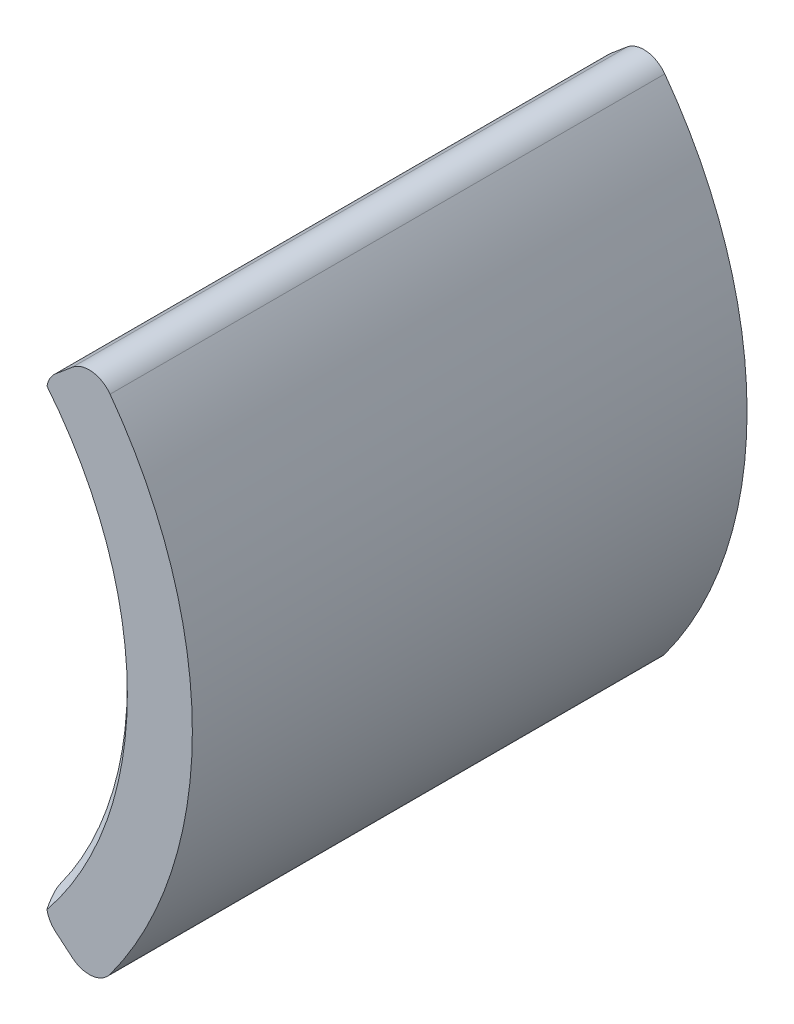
ISO-10303-21;
HEADER;
FILE_DESCRIPTION(('STEP AP214'),'2;1');
FILE_NAME('part.step','',(''),(''),'','','');
FILE_SCHEMA(('AUTOMOTIVE_DESIGN { 1 0 10303 214 1 1 1 1 }'));
ENDSEC;
DATA;
#1=APPLICATION_CONTEXT('core data for automotive mechanical design processes');
#2=APPLICATION_PROTOCOL_DEFINITION('international standard','automotive_design',2000,#1);
#3=PRODUCT_CONTEXT('',#1,'mechanical');
#4=PRODUCT('Part','Part','',(#3));
#5=PRODUCT_RELATED_PRODUCT_CATEGORY('part','',(#4));
#6=PRODUCT_DEFINITION_FORMATION('','',#4);
#7=PRODUCT_DEFINITION_CONTEXT('part definition',#1,'design');
#8=PRODUCT_DEFINITION('design','',#6,#7);
#9=PRODUCT_DEFINITION_SHAPE('','',#8);
#10=(LENGTH_UNIT() NAMED_UNIT(*) SI_UNIT(.MILLI.,.METRE.));
#11=(NAMED_UNIT(*) PLANE_ANGLE_UNIT() SI_UNIT($,.RADIAN.));
#12=(NAMED_UNIT(*) SI_UNIT($,.STERADIAN.) SOLID_ANGLE_UNIT());
#13=UNCERTAINTY_MEASURE_WITH_UNIT(LENGTH_MEASURE(1.E-05),#10,'distance_accuracy_value','');
#14=(GEOMETRIC_REPRESENTATION_CONTEXT(3) GLOBAL_UNCERTAINTY_ASSIGNED_CONTEXT((#13)) GLOBAL_UNIT_ASSIGNED_CONTEXT((#10,
#11,#12)) REPRESENTATION_CONTEXT('',''));
#15=CARTESIAN_POINT('',(0.,0.,0.));
#16=DIRECTION('',(0.,0.,1.));
#17=DIRECTION('',(1.,0.,0.));
#18=AXIS2_PLACEMENT_3D('',#15,#16,#17);
#19=CARTESIAN_POINT('',(0.,0.,64.));
#20=DIRECTION('',(0.,0.,-1.));
#21=DIRECTION('',(-1.,0.,0.));
#22=AXIS2_PLACEMENT_3D('',#19,#20,#21);
#23=CYLINDRICAL_SURFACE('',#22,49.);
#24=CARTESIAN_POINT('',(0.,0.,64.));
#25=DIRECTION('',(0.,0.,1.));
#26=DIRECTION('',(1.,0.,0.));
#27=AXIS2_PLACEMENT_3D('',#24,#25,#26);
#28=CIRCLE('',#27,49.);
#29=CARTESIAN_POINT('',(39.5103918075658,-28.9815275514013,64.));
#30=VERTEX_POINT('',#29);
#31=CARTESIAN_POINT('',(39.5103918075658,28.9815275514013,64.));
#32=VERTEX_POINT('',#31);
#33=EDGE_CURVE('E132',#30,#32,#28,.T.);
#34=ORIENTED_EDGE('',*,*,#33,.F.);
#35=DIRECTION('',(0.,0.,-1.));
#36=VECTOR('',#35,1.);
#37=CARTESIAN_POINT('',(39.5103918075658,-28.9815275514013,64.));
#38=LINE('',#37,#36);
#39=CARTESIAN_POINT('',(39.5103918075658,-28.9815275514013,0.));
#40=VERTEX_POINT('',#39);
#41=EDGE_CURVE('E117',#30,#40,#38,.T.);
#42=ORIENTED_EDGE('',*,*,#41,.T.);
#43=CARTESIAN_POINT('',(0.,0.,0.));
#44=DIRECTION('',(0.,0.,1.));
#45=DIRECTION('',(1.,0.,0.));
#46=AXIS2_PLACEMENT_3D('',#43,#44,#45);
#47=CIRCLE('',#46,49.);
#48=CARTESIAN_POINT('',(39.5103918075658,28.9815275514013,0.));
#49=VERTEX_POINT('',#48);
#50=EDGE_CURVE('E129',#40,#49,#47,.T.);
#51=ORIENTED_EDGE('',*,*,#50,.T.);
#52=DIRECTION('',(0.,0.,-1.));
#53=VECTOR('',#52,1.);
#54=CARTESIAN_POINT('',(39.5103918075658,28.9815275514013,64.));
#55=LINE('',#54,#53);
#56=EDGE_CURVE('E134',#49,#32,#55,.F.);
#57=ORIENTED_EDGE('',*,*,#56,.T.);
#58=EDGE_LOOP('',(#34,#42,#51,#57));
#59=FACE_BOUND('',#58,.T.);
#60=ADVANCED_FACE('F35',(#59),#23,.T.);
#61=CARTESIAN_POINT('',(31.0247999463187,26.0328981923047,64.));
#62=DIRECTION('',(0.642787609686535,-0.766044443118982,0.));
#63=DIRECTION('',(0.766044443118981,0.642787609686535,0.));
#64=AXIS2_PLACEMENT_3D('',#61,#62,#63);
#65=PLANE('',#64);
#66=DIRECTION('',(-0.766044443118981,-0.642787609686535,0.));
#67=VECTOR('',#66,1.);
#68=CARTESIAN_POINT('',(31.0247999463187,26.0328981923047,64.));
#69=LINE('',#68,#67);
#70=CARTESIAN_POINT('',(35.1630253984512,29.5052816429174,64.));
#71=VERTEX_POINT('',#70);
#72=CARTESIAN_POINT('',(33.2435928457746,27.8946864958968,64.));
#73=VERTEX_POINT('',#72);
#74=EDGE_CURVE('E150',#71,#73,#69,.T.);
#75=ORIENTED_EDGE('',*,*,#74,.F.);
#76=DIRECTION('',(0.,0.,-1.));
#77=VECTOR('',#76,1.);
#78=CARTESIAN_POINT('',(35.1630253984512,29.5052816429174,64.));
#79=LINE('',#78,#77);
#80=CARTESIAN_POINT('',(35.1630253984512,29.5052816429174,0.));
#81=VERTEX_POINT('',#80);
#82=EDGE_CURVE('E11',#71,#81,#79,.T.);
#83=ORIENTED_EDGE('',*,*,#82,.T.);
#84=DIRECTION('',(-0.766044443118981,-0.642787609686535,0.));
#85=VECTOR('',#84,1.);
#86=CARTESIAN_POINT('',(31.0247999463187,26.0328981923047,0.));
#87=LINE('',#86,#85);
#88=CARTESIAN_POINT('',(33.2435928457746,27.8946864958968,0.));
#89=VERTEX_POINT('',#88);
#90=EDGE_CURVE('E139',#81,#89,#87,.T.);
#91=ORIENTED_EDGE('',*,*,#90,.T.);
#92=DIRECTION('',(0.,0.,-1.));
#93=VECTOR('',#92,1.);
#94=CARTESIAN_POINT('',(33.2435928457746,27.8946864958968,64.));
#95=LINE('',#94,#93);
#96=EDGE_CURVE('E42',#89,#73,#95,.F.);
#97=ORIENTED_EDGE('',*,*,#96,.T.);
#98=EDGE_LOOP('',(#75,#83,#91,#97));
#99=FACE_BOUND('',#98,.T.);
#100=ADVANCED_FACE('F229',(#99),#65,.F.);
#101=CARTESIAN_POINT('',(0.,0.,64.));
#102=DIRECTION('',(0.,0.,-1.));
#103=DIRECTION('',(-1.,0.,0.));
#104=AXIS2_PLACEMENT_3D('',#101,#102,#103);
#105=CYLINDRICAL_SURFACE('',#104,40.5);
#106=CARTESIAN_POINT('',(0.,0.,0.999999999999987));
#107=DIRECTION('',(0.,0.,1.));
#108=DIRECTION('',(1.,0.,0.));
#109=AXIS2_PLACEMENT_3D('',#106,#107,#108);
#110=CIRCLE('',#109,40.5);
#111=CARTESIAN_POINT('',(32.7463035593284,23.831273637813,0.999999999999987));
#112=VERTEX_POINT('',#111);
#113=CARTESIAN_POINT('',(32.7463035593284,-23.831273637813,0.999999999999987));
#114=VERTEX_POINT('',#113);
#115=EDGE_CURVE('E155',#112,#114,#110,.F.);
#116=ORIENTED_EDGE('',*,*,#115,.T.);
#117=DIRECTION('',(0.,0.,-1.));
#118=VECTOR('',#117,1.);
#119=CARTESIAN_POINT('',(32.7463035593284,-23.831273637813,64.));
#120=LINE('',#119,#118);
#121=CARTESIAN_POINT('',(32.7463035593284,-23.831273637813,63.));
#122=VERTEX_POINT('',#121);
#123=EDGE_CURVE('E56',#114,#122,#120,.F.);
#124=ORIENTED_EDGE('',*,*,#123,.T.);
#125=CARTESIAN_POINT('',(0.,0.,63.));
#126=DIRECTION('',(0.,0.,1.));
#127=DIRECTION('',(1.,0.,0.));
#128=AXIS2_PLACEMENT_3D('',#125,#126,#127);
#129=CIRCLE('',#128,40.5);
#130=CARTESIAN_POINT('',(32.7463035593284,23.831273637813,63.));
#131=VERTEX_POINT('',#130);
#132=EDGE_CURVE('E153',#122,#131,#129,.T.);
#133=ORIENTED_EDGE('',*,*,#132,.T.);
#134=DIRECTION('',(0.,0.,-1.));
#135=VECTOR('',#134,1.);
#136=CARTESIAN_POINT('',(32.7463035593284,23.831273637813,64.));
#137=LINE('',#136,#135);
#138=EDGE_CURVE('E259',#131,#112,#137,.T.);
#139=ORIENTED_EDGE('',*,*,#138,.T.);
#140=EDGE_LOOP('',(#116,#124,#133,#139));
#141=FACE_BOUND('',#140,.T.);
#142=ADVANCED_FACE('F233',(#141),#105,.F.);
#143=CARTESIAN_POINT('',(0.,0.,64.));
#144=DIRECTION('',(0.,0.,1.));
#145=DIRECTION('',(1.,0.,0.));
#146=AXIS2_PLACEMENT_3D('',#143,#144,#145);
#147=PLANE('',#146);
#148=DIRECTION('',(-0.766044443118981,0.642787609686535,0.));
#149=VECTOR('',#148,1.);
#150=CARTESIAN_POINT('',(31.0247999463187,-26.0328981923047,64.));
#151=LINE('',#150,#149);
#152=CARTESIAN_POINT('',(35.1630253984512,-29.5052816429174,64.));
#153=VERTEX_POINT('',#152);
#154=CARTESIAN_POINT('',(33.2435928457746,-27.8946864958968,64.));
#155=VERTEX_POINT('',#154);
#156=EDGE_CURVE('E140',#153,#155,#151,.T.);
#157=ORIENTED_EDGE('',*,*,#156,.F.);
#158=CARTESIAN_POINT('',(37.0913882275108,-27.2071483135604,64.));
#159=DIRECTION('',(0.,0.,1.));
#160=DIRECTION('',(1.,0.,0.));
#161=AXIS2_PLACEMENT_3D('',#158,#159,#160);
#162=CIRCLE('',#161,3.);
#163=EDGE_CURVE('E176',#153,#30,#162,.T.);
#164=ORIENTED_EDGE('',*,*,#163,.T.);
#165=ORIENTED_EDGE('',*,*,#33,.T.);
#166=CARTESIAN_POINT('',(37.0913882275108,27.2071483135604,64.));
#167=DIRECTION('',(0.,0.,1.));
#168=DIRECTION('',(1.,0.,0.));
#169=AXIS2_PLACEMENT_3D('',#166,#167,#168);
#170=CIRCLE('',#169,3.);
#171=EDGE_CURVE('E172',#32,#71,#170,.T.);
#172=ORIENTED_EDGE('',*,*,#171,.T.);
#173=ORIENTED_EDGE('',*,*,#74,.T.);
#174=CARTESIAN_POINT('',(35.1719556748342,25.5965531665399,64.));
#175=DIRECTION('',(0.,0.,1.));
#176=DIRECTION('',(1.,0.,0.));
#177=AXIS2_PLACEMENT_3D('',#174,#175,#176);
#178=CIRCLE('',#177,3.);
#179=CARTESIAN_POINT('',(32.2236724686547,26.1511937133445,64.));
#180=VERTEX_POINT('',#179);
#181=EDGE_CURVE('E170',#73,#180,#178,.T.);
#182=ORIENTED_EDGE('',*,*,#181,.T.);
#183=CARTESIAN_POINT('',(0.,0.,64.));
#184=DIRECTION('',(0.,0.,1.));
#185=DIRECTION('',(1.,0.,0.));
#186=AXIS2_PLACEMENT_3D('',#183,#184,#185);
#187=CIRCLE('',#186,41.5);
#188=CARTESIAN_POINT('',(32.2236724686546,-26.1511937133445,64.));
#189=VERTEX_POINT('',#188);
#190=EDGE_CURVE('E160',#180,#189,#187,.F.);
#191=ORIENTED_EDGE('',*,*,#190,.T.);
#192=CARTESIAN_POINT('',(35.1719556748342,-25.5965531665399,64.));
#193=DIRECTION('',(0.,0.,1.));
#194=DIRECTION('',(1.,0.,0.));
#195=AXIS2_PLACEMENT_3D('',#192,#193,#194);
#196=CIRCLE('',#195,3.);
#197=EDGE_CURVE('E174',#189,#155,#196,.T.);
#198=ORIENTED_EDGE('',*,*,#197,.T.);
#199=EDGE_LOOP('',(#157,#164,#165,#172,#173,#182,#191,#198));
#200=FACE_BOUND('',#199,.T.);
#201=ADVANCED_FACE('F238',(#200),#147,.T.);
#202=CARTESIAN_POINT('',(0.,0.,0.));
#203=DIRECTION('',(0.,0.,1.));
#204=DIRECTION('',(1.,0.,0.));
#205=AXIS2_PLACEMENT_3D('',#202,#203,#204);
#206=PLANE('',#205);
#207=ORIENTED_EDGE('',*,*,#50,.F.);
#208=CARTESIAN_POINT('',(37.0913882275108,-27.2071483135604,0.));
#209=DIRECTION('',(0.,0.,1.));
#210=DIRECTION('',(1.,0.,0.));
#211=AXIS2_PLACEMENT_3D('',#208,#209,#210);
#212=CIRCLE('',#211,3.);
#213=CARTESIAN_POINT('',(35.1630253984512,-29.5052816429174,0.));
#214=VERTEX_POINT('',#213);
#215=EDGE_CURVE('E113',#40,#214,#212,.F.);
#216=ORIENTED_EDGE('',*,*,#215,.T.);
#217=DIRECTION('',(-0.766044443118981,0.642787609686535,0.));
#218=VECTOR('',#217,1.);
#219=CARTESIAN_POINT('',(31.0247999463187,-26.0328981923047,0.));
#220=LINE('',#219,#218);
#221=CARTESIAN_POINT('',(33.2435928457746,-27.8946864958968,0.));
#222=VERTEX_POINT('',#221);
#223=EDGE_CURVE('E145',#214,#222,#220,.T.);
#224=ORIENTED_EDGE('',*,*,#223,.T.);
#225=CARTESIAN_POINT('',(35.1719556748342,-25.5965531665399,0.));
#226=DIRECTION('',(0.,0.,1.));
#227=DIRECTION('',(1.,0.,0.));
#228=AXIS2_PLACEMENT_3D('',#225,#226,#227);
#229=CIRCLE('',#228,3.);
#230=CARTESIAN_POINT('',(32.2236724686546,-26.1511937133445,0.));
#231=VERTEX_POINT('',#230);
#232=EDGE_CURVE('E124',#222,#231,#229,.F.);
#233=ORIENTED_EDGE('',*,*,#232,.T.);
#234=CARTESIAN_POINT('',(0.,0.,0.));
#235=DIRECTION('',(0.,0.,1.));
#236=DIRECTION('',(1.,0.,0.));
#237=AXIS2_PLACEMENT_3D('',#234,#235,#236);
#238=CIRCLE('',#237,41.5);
#239=CARTESIAN_POINT('',(32.2236724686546,26.1511937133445,0.));
#240=VERTEX_POINT('',#239);
#241=EDGE_CURVE('E157',#231,#240,#238,.T.);
#242=ORIENTED_EDGE('',*,*,#241,.T.);
#243=CARTESIAN_POINT('',(35.1719556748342,25.5965531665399,0.));
#244=DIRECTION('',(0.,0.,1.));
#245=DIRECTION('',(1.,0.,0.));
#246=AXIS2_PLACEMENT_3D('',#243,#244,#245);
#247=CIRCLE('',#246,3.);
#248=EDGE_CURVE('E133',#240,#89,#247,.F.);
#249=ORIENTED_EDGE('',*,*,#248,.T.);
#250=ORIENTED_EDGE('',*,*,#90,.F.);
#251=CARTESIAN_POINT('',(37.0913882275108,27.2071483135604,0.));
#252=DIRECTION('',(0.,0.,1.));
#253=DIRECTION('',(1.,0.,0.));
#254=AXIS2_PLACEMENT_3D('',#251,#252,#253);
#255=CIRCLE('',#254,3.);
#256=EDGE_CURVE('E138',#81,#49,#255,.F.);
#257=ORIENTED_EDGE('',*,*,#256,.T.);
#258=EDGE_LOOP('',(#207,#216,#224,#233,#242,#249,#250,#257));
#259=FACE_BOUND('',#258,.T.);
#260=ADVANCED_FACE('F136',(#259),#206,.F.);
#261=CARTESIAN_POINT('',(31.0247999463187,-26.0328981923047,64.));
#262=DIRECTION('',(-0.642787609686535,-0.766044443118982,0.));
#263=DIRECTION('',(0.766044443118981,-0.642787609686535,0.));
#264=AXIS2_PLACEMENT_3D('',#261,#262,#263);
#265=PLANE('',#264);
#266=ORIENTED_EDGE('',*,*,#223,.F.);
#267=DIRECTION('',(0.,0.,1.));
#268=VECTOR('',#267,1.);
#269=CARTESIAN_POINT('',(35.1630253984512,-29.5052816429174,64.));
#270=LINE('',#269,#268);
#271=EDGE_CURVE('E118',#214,#153,#270,.T.);
#272=ORIENTED_EDGE('',*,*,#271,.T.);
#273=ORIENTED_EDGE('',*,*,#156,.T.);
#274=DIRECTION('',(0.,0.,1.));
#275=VECTOR('',#274,1.);
#276=CARTESIAN_POINT('',(33.2435928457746,-27.8946864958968,1.));
#277=LINE('',#276,#275);
#278=EDGE_CURVE('E123',#155,#222,#277,.F.);
#279=ORIENTED_EDGE('',*,*,#278,.T.);
#280=EDGE_LOOP('',(#266,#272,#273,#279));
#281=FACE_BOUND('',#280,.T.);
#282=ADVANCED_FACE('F246',(#281),#265,.T.);
#283=CARTESIAN_POINT('',(0.,0.,0.999999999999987));
#284=DIRECTION('',(0.,0.,-1.));
#285=DIRECTION('',(-1.,0.,0.));
#286=AXIS2_PLACEMENT_3D('',#283,#284,#285);
#287=CONICAL_SURFACE('',#286,40.5,0.785398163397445);
#288=ORIENTED_EDGE('',*,*,#241,.F.);
#289=CARTESIAN_POINT('',(32.2236724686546,-26.1511937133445,0.));
#290=CARTESIAN_POINT('',(32.2103514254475,-26.0803026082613,0.0550138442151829));
#291=CARTESIAN_POINT('',(32.1994088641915,-26.0081324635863,0.108911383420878));
#292=CARTESIAN_POINT('',(32.1827254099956,-25.8611500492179,0.214116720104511));
#293=CARTESIAN_POINT('',(32.1769941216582,-25.7863331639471,0.265419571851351));
#294=CARTESIAN_POINT('',(32.1682774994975,-25.5563131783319,0.415823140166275));
#295=CARTESIAN_POINT('',(32.1741225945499,-25.3972904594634,0.510038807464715));
#296=CARTESIAN_POINT('',(32.2087179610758,-25.1122841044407,0.658634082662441));
#297=CARTESIAN_POINT('',(32.2315267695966,-24.9877144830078,0.717123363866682));
#298=CARTESIAN_POINT('',(32.2946110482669,-24.7379064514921,0.819634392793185));
#299=CARTESIAN_POINT('',(32.3347502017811,-24.6126806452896,0.863764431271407));
#300=CARTESIAN_POINT('',(32.4064903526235,-24.4321064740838,0.915458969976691));
#301=CARTESIAN_POINT('',(32.4308866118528,-24.3757486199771,0.929864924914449));
#302=CARTESIAN_POINT('',(32.4834677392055,-24.2639461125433,0.954826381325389));
#303=CARTESIAN_POINT('',(32.511651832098,-24.2085012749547,0.96538266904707));
#304=CARTESIAN_POINT('',(32.5721193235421,-24.0982707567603,0.982526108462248));
#305=CARTESIAN_POINT('',(32.6044524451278,-24.0435037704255,0.98905836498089));
#306=CARTESIAN_POINT('',(32.6727281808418,-23.9358446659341,0.997805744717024));
#307=CARTESIAN_POINT('',(32.7086738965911,-23.8829542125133,1.00001712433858));
#308=CARTESIAN_POINT('',(32.7463035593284,-23.831273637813,0.999999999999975));
#309=B_SPLINE_CURVE_WITH_KNOTS('',3,(#289,#290,#291,#292,#293,#294,#295,#296,#297,#298,#299,
#300,#301,#302,#303,#304,#305,#306,#307,#308),.UNSPECIFIED.,.F.,.F.,(4,2,2,2,2,2,2,2,2,4),(0.,
0.272028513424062,0.544557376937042,1.09632284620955,1.51335887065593,1.92717269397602,
2.11621517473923,2.30521902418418,2.49674722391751,2.68844128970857),.UNSPECIFIED.);
#310=EDGE_CURVE('E185',#231,#114,#309,.T.);
#311=ORIENTED_EDGE('',*,*,#310,.T.);
#312=ORIENTED_EDGE('',*,*,#115,.F.);
#313=CARTESIAN_POINT('',(32.7463035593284,23.831273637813,0.999999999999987));
#314=CARTESIAN_POINT('',(32.7072914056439,23.8848497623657,1.00001983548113));
#315=CARTESIAN_POINT('',(32.6700917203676,23.9397267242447,0.997641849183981));
#316=CARTESIAN_POINT('',(32.5995878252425,24.0514783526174,0.988243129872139));
#317=CARTESIAN_POINT('',(32.5662800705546,24.1083511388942,0.981226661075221));
#318=CARTESIAN_POINT('',(32.5041909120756,24.2227930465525,0.962831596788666));
#319=CARTESIAN_POINT('',(32.475353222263,24.2803416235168,0.951514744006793));
#320=CARTESIAN_POINT('',(32.4217495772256,24.396363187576,0.924780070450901));
#321=CARTESIAN_POINT('',(32.3969842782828,24.4548363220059,0.909361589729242));
#322=CARTESIAN_POINT('',(32.3289996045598,24.6304869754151,0.857526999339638));
#323=CARTESIAN_POINT('',(32.2918191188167,24.7484051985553,0.815446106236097));
#324=CARTESIAN_POINT('',(32.2326988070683,24.983652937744,0.718665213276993));
#325=CARTESIAN_POINT('',(32.2108706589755,25.1009720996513,0.663876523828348));
#326=CARTESIAN_POINT('',(32.1749770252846,25.3822155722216,0.518718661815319));
#327=CARTESIAN_POINT('',(32.1683054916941,25.5444468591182,0.423189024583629));
#328=CARTESIAN_POINT('',(32.1765015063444,25.7790659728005,0.270350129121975));
#329=CARTESIAN_POINT('',(32.1821854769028,25.855412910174,0.218132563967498));
#330=CARTESIAN_POINT('',(32.1989878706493,26.0053427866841,0.110993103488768));
#331=CARTESIAN_POINT('',(32.2100952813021,26.0789310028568,0.0560768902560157));
#332=CARTESIAN_POINT('',(32.2236724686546,26.1511937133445,0.));
#333=B_SPLINE_CURVE_WITH_KNOTS('',3,(#313,#314,#315,#316,#317,#318,#319,#320,#321,#322,#323,
#324,#325,#326,#327,#328,#329,#330,#331,#332),.UNSPECIFIED.,.F.,.F.,(4,2,2,2,2,2,2,2,2,4),(0.,
0.198721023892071,0.397259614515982,0.593049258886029,0.788870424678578,1.17878455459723,
1.57150650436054,2.13339445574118,2.41123473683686,2.6885131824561),.UNSPECIFIED.);
#334=EDGE_CURVE('E178',#112,#240,#333,.T.);
#335=ORIENTED_EDGE('',*,*,#334,.T.);
#336=EDGE_LOOP('',(#288,#311,#312,#335));
#337=FACE_BOUND('',#336,.T.);
#338=ADVANCED_FACE('F191',(#337),#287,.F.);
#339=CARTESIAN_POINT('',(0.,0.,64.));
#340=DIRECTION('',(0.,0.,1.));
#341=DIRECTION('',(1.,0.,0.));
#342=AXIS2_PLACEMENT_3D('',#339,#340,#341);
#343=CONICAL_SURFACE('',#342,41.5,0.785398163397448);
#344=ORIENTED_EDGE('',*,*,#132,.F.);
#345=CARTESIAN_POINT('',(32.7463035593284,-23.831273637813,63.));
#346=CARTESIAN_POINT('',(32.7072914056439,-23.8848497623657,62.9999801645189));
#347=CARTESIAN_POINT('',(32.6700917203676,-23.9397267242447,63.002358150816));
#348=CARTESIAN_POINT('',(32.5995878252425,-24.0514783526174,63.0117568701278));
#349=CARTESIAN_POINT('',(32.5662800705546,-24.1083511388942,63.0187733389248));
#350=CARTESIAN_POINT('',(32.5041909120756,-24.2227930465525,63.0371684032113));
#351=CARTESIAN_POINT('',(32.475353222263,-24.2803416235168,63.0484852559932));
#352=CARTESIAN_POINT('',(32.4217495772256,-24.396363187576,63.0752199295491));
#353=CARTESIAN_POINT('',(32.3969842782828,-24.454836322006,63.0906384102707));
#354=CARTESIAN_POINT('',(32.3289996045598,-24.6304869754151,63.1424730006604));
#355=CARTESIAN_POINT('',(32.2918191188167,-24.7484051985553,63.1845538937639));
#356=CARTESIAN_POINT('',(32.2326988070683,-24.983652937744,63.281334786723));
#357=CARTESIAN_POINT('',(32.2108706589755,-25.1009720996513,63.3361234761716));
#358=CARTESIAN_POINT('',(32.1749770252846,-25.3822155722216,63.4812813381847));
#359=CARTESIAN_POINT('',(32.1683054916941,-25.5444468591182,63.5768109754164));
#360=CARTESIAN_POINT('',(32.1765015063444,-25.7790659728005,63.729649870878));
#361=CARTESIAN_POINT('',(32.1821854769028,-25.855412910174,63.7818674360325));
#362=CARTESIAN_POINT('',(32.1989878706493,-26.0053427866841,63.8890068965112));
#363=CARTESIAN_POINT('',(32.2100952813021,-26.0789310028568,63.943923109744));
#364=CARTESIAN_POINT('',(32.2236724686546,-26.1511937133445,64.));
#365=B_SPLINE_CURVE_WITH_KNOTS('',3,(#345,#346,#347,#348,#349,#350,#351,#352,#353,#354,#355,
#356,#357,#358,#359,#360,#361,#362,#363,#364),.UNSPECIFIED.,.F.,.F.,(4,2,2,2,2,2,2,2,2,4),(0.,
0.198721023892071,0.397259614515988,0.593049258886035,0.78887042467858,1.17878455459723,
1.57150650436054,2.13339445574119,2.41123473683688,2.68851318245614),.UNSPECIFIED.);
#366=EDGE_CURVE('E208',#122,#189,#365,.T.);
#367=ORIENTED_EDGE('',*,*,#366,.T.);
#368=ORIENTED_EDGE('',*,*,#190,.F.);
#369=CARTESIAN_POINT('',(32.2236724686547,26.1511937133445,64.));
#370=CARTESIAN_POINT('',(32.2103514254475,26.0803026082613,63.9449861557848));
#371=CARTESIAN_POINT('',(32.1994088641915,26.0081324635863,63.8910886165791));
#372=CARTESIAN_POINT('',(32.1827254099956,25.861150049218,63.7858832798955));
#373=CARTESIAN_POINT('',(32.1769941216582,25.7863331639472,63.7345804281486));
#374=CARTESIAN_POINT('',(32.1682774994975,25.5563131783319,63.5841768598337));
#375=CARTESIAN_POINT('',(32.1741225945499,25.3972904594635,63.4899611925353));
#376=CARTESIAN_POINT('',(32.2087179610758,25.1122841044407,63.3413659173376));
#377=CARTESIAN_POINT('',(32.2315267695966,24.9877144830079,63.2828766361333));
#378=CARTESIAN_POINT('',(32.2946110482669,24.7379064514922,63.1803656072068));
#379=CARTESIAN_POINT('',(32.3347502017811,24.6126806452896,63.1362355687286));
#380=CARTESIAN_POINT('',(32.4064903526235,24.4321064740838,63.0845410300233));
#381=CARTESIAN_POINT('',(32.4308866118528,24.3757486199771,63.0701350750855));
#382=CARTESIAN_POINT('',(32.4834677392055,24.2639461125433,63.0451736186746));
#383=CARTESIAN_POINT('',(32.511651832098,24.2085012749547,63.0346173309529));
#384=CARTESIAN_POINT('',(32.5721193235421,24.0982707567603,63.0174738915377));
#385=CARTESIAN_POINT('',(32.6044524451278,24.0435037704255,63.0109416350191));
#386=CARTESIAN_POINT('',(32.6727281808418,23.9358446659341,63.002194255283));
#387=CARTESIAN_POINT('',(32.7086738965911,23.8829542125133,62.9999828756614));
#388=CARTESIAN_POINT('',(32.7463035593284,23.831273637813,63.));
#389=B_SPLINE_CURVE_WITH_KNOTS('',3,(#369,#370,#371,#372,#373,#374,#375,#376,#377,#378,#379,
#380,#381,#382,#383,#384,#385,#386,#387,#388),.UNSPECIFIED.,.F.,.F.,(4,2,2,2,2,2,2,2,2,4),(0.,
0.272028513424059,0.544557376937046,1.09632284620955,1.51335887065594,1.92717269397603,
2.11621517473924,2.3052190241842,2.49674722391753,2.6884412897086),.UNSPECIFIED.);
#390=EDGE_CURVE('E49',#180,#131,#389,.T.);
#391=ORIENTED_EDGE('',*,*,#390,.T.);
#392=EDGE_LOOP('',(#344,#367,#368,#391));
#393=FACE_BOUND('',#392,.T.);
#394=ADVANCED_FACE('F212',(#393),#343,.F.);
#395=CARTESIAN_POINT('',(37.0913882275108,-27.2071483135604,64.));
#396=DIRECTION('',(0.,0.,-1.));
#397=DIRECTION('',(-1.,0.,0.));
#398=AXIS2_PLACEMENT_3D('',#395,#396,#397);
#399=CYLINDRICAL_SURFACE('',#398,3.);
#400=ORIENTED_EDGE('',*,*,#163,.F.);
#401=ORIENTED_EDGE('',*,*,#271,.F.);
#402=ORIENTED_EDGE('',*,*,#215,.F.);
#403=ORIENTED_EDGE('',*,*,#41,.F.);
#404=EDGE_LOOP('',(#400,#401,#402,#403));
#405=FACE_BOUND('',#404,.T.);
#406=ADVANCED_FACE('F116',(#405),#399,.T.);
#407=CARTESIAN_POINT('',(35.1719556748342,-25.5965531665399,64.));
#408=DIRECTION('',(0.,0.,-1.));
#409=DIRECTION('',(-1.,0.,0.));
#410=AXIS2_PLACEMENT_3D('',#407,#408,#409);
#411=CYLINDRICAL_SURFACE('',#410,3.);
#412=ORIENTED_EDGE('',*,*,#366,.F.);
#413=ORIENTED_EDGE('',*,*,#123,.F.);
#414=ORIENTED_EDGE('',*,*,#310,.F.);
#415=ORIENTED_EDGE('',*,*,#232,.F.);
#416=ORIENTED_EDGE('',*,*,#278,.F.);
#417=ORIENTED_EDGE('',*,*,#197,.F.);
#418=EDGE_LOOP('',(#412,#413,#414,#415,#416,#417));
#419=FACE_BOUND('',#418,.T.);
#420=ADVANCED_FACE('F218',(#419),#411,.T.);
#421=CARTESIAN_POINT('',(37.0913882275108,27.2071483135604,64.));
#422=DIRECTION('',(0.,0.,-1.));
#423=DIRECTION('',(-1.,0.,0.));
#424=AXIS2_PLACEMENT_3D('',#421,#422,#423);
#425=CYLINDRICAL_SURFACE('',#424,3.);
#426=ORIENTED_EDGE('',*,*,#171,.F.);
#427=ORIENTED_EDGE('',*,*,#56,.F.);
#428=ORIENTED_EDGE('',*,*,#256,.F.);
#429=ORIENTED_EDGE('',*,*,#82,.F.);
#430=EDGE_LOOP('',(#426,#427,#428,#429));
#431=FACE_BOUND('',#430,.T.);
#432=ADVANCED_FACE('F199',(#431),#425,.T.);
#433=CARTESIAN_POINT('',(35.1719556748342,25.5965531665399,64.));
#434=DIRECTION('',(0.,0.,-1.));
#435=DIRECTION('',(-1.,0.,0.));
#436=AXIS2_PLACEMENT_3D('',#433,#434,#435);
#437=CYLINDRICAL_SURFACE('',#436,3.);
#438=ORIENTED_EDGE('',*,*,#181,.F.);
#439=ORIENTED_EDGE('',*,*,#96,.F.);
#440=ORIENTED_EDGE('',*,*,#248,.F.);
#441=ORIENTED_EDGE('',*,*,#334,.F.);
#442=ORIENTED_EDGE('',*,*,#138,.F.);
#443=ORIENTED_EDGE('',*,*,#390,.F.);
#444=EDGE_LOOP('',(#438,#439,#440,#441,#442,#443));
#445=FACE_BOUND('',#444,.T.);
#446=ADVANCED_FACE('F195',(#445),#437,.T.);
#447=CLOSED_SHELL('',(#60,#100,#142,#201,#260,#282,#338,#394,#406,#420,#432,#446));
#448=MANIFOLD_SOLID_BREP('B2',#447);
#449=ADVANCED_BREP_SHAPE_REPRESENTATION('',(#18,#448),#14);
#450=SHAPE_DEFINITION_REPRESENTATION(#9,#449);
ENDSEC;
END-ISO-10303-21;
